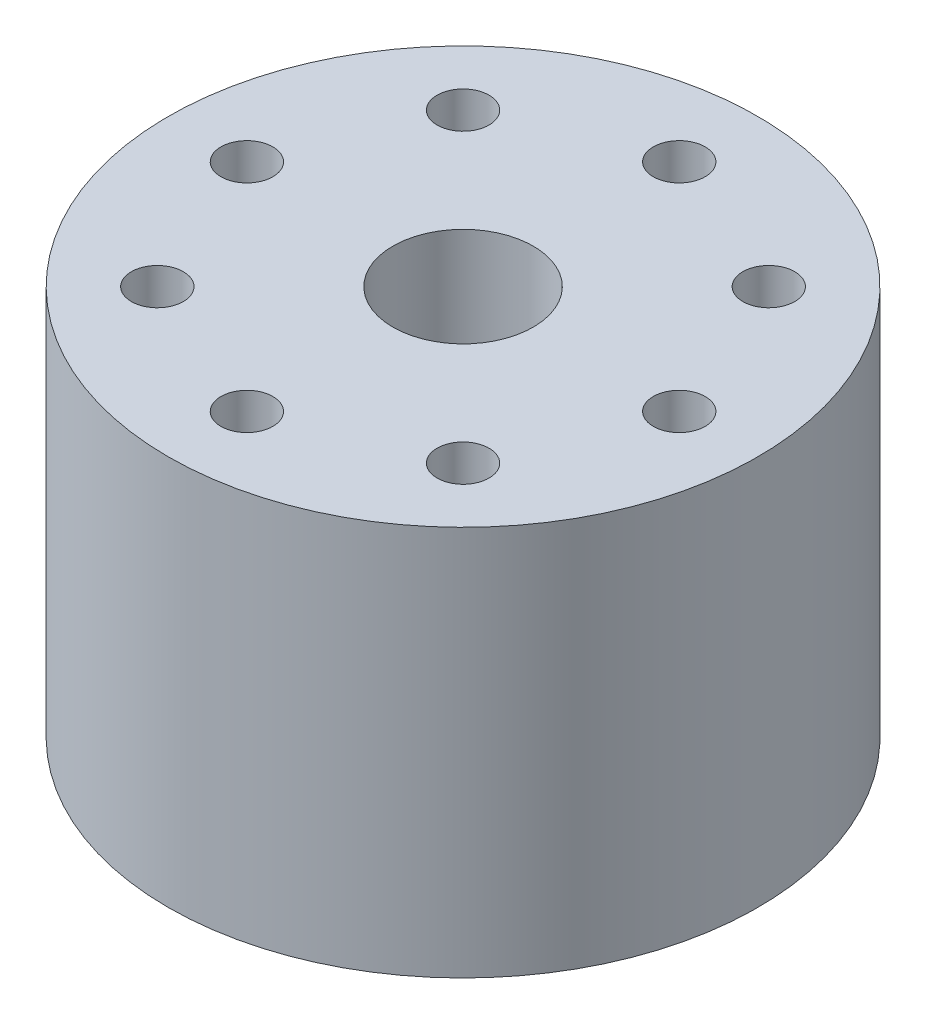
ISO-10303-21;
HEADER;
FILE_DESCRIPTION(('STEP AP214'),'2;1');
FILE_NAME('part.step','',(''),(''),'','','');
FILE_SCHEMA(('AUTOMOTIVE_DESIGN { 1 0 10303 214 1 1 1 1 }'));
ENDSEC;
DATA;
#1=APPLICATION_CONTEXT('core data for automotive mechanical design processes');
#2=APPLICATION_PROTOCOL_DEFINITION('international standard','automotive_design',2000,#1);
#3=PRODUCT_CONTEXT('',#1,'mechanical');
#4=PRODUCT('Part','Part','',(#3));
#5=PRODUCT_RELATED_PRODUCT_CATEGORY('part','',(#4));
#6=PRODUCT_DEFINITION_FORMATION('','',#4);
#7=PRODUCT_DEFINITION_CONTEXT('part definition',#1,'design');
#8=PRODUCT_DEFINITION('design','',#6,#7);
#9=PRODUCT_DEFINITION_SHAPE('','',#8);
#10=(LENGTH_UNIT() NAMED_UNIT(*) SI_UNIT(.MILLI.,.METRE.));
#11=(NAMED_UNIT(*) PLANE_ANGLE_UNIT() SI_UNIT($,.RADIAN.));
#12=(NAMED_UNIT(*) SI_UNIT($,.STERADIAN.) SOLID_ANGLE_UNIT());
#13=UNCERTAINTY_MEASURE_WITH_UNIT(LENGTH_MEASURE(1.E-05),#10,'distance_accuracy_value','');
#14=(GEOMETRIC_REPRESENTATION_CONTEXT(3) GLOBAL_UNCERTAINTY_ASSIGNED_CONTEXT((#13)) GLOBAL_UNIT_ASSIGNED_CONTEXT((#10,
#11,#12)) REPRESENTATION_CONTEXT('',''));
#15=CARTESIAN_POINT('',(0.,0.,0.));
#16=DIRECTION('',(0.,0.,1.));
#17=DIRECTION('',(1.,0.,0.));
#18=AXIS2_PLACEMENT_3D('',#15,#16,#17);
#19=CARTESIAN_POINT('',(0.,49.65,0.));
#20=DIRECTION('',(0.,-1.,0.));
#21=DIRECTION('',(0.,0.,-1.));
#22=AXIS2_PLACEMENT_3D('',#19,#20,#21);
#23=CYLINDRICAL_SURFACE('',#22,37.5);
#24=CARTESIAN_POINT('',(0.,49.65,0.));
#25=DIRECTION('',(0.,1.,0.));
#26=DIRECTION('',(0.,0.,1.));
#27=AXIS2_PLACEMENT_3D('',#24,#25,#26);
#28=CIRCLE('',#27,37.5);
#29=CARTESIAN_POINT('',(0.,49.65,37.5));
#30=VERTEX_POINT('',#29);
#31=EDGE_CURVE('E54',#30,#30,#28,.T.);
#32=ORIENTED_EDGE('',*,*,#31,.F.);
#33=EDGE_LOOP('',(#32));
#34=FACE_BOUND('',#33,.T.);
#35=CARTESIAN_POINT('',(0.,0.,0.));
#36=DIRECTION('',(0.,1.,0.));
#37=DIRECTION('',(0.,0.,1.));
#38=AXIS2_PLACEMENT_3D('',#35,#36,#37);
#39=CIRCLE('',#38,37.5);
#40=CARTESIAN_POINT('',(0.,0.,37.5));
#41=VERTEX_POINT('',#40);
#42=EDGE_CURVE('E58',#41,#41,#39,.T.);
#43=ORIENTED_EDGE('',*,*,#42,.T.);
#44=EDGE_LOOP('',(#43));
#45=FACE_BOUND('',#44,.T.);
#46=ADVANCED_FACE('F43',(#34,#45),#23,.T.);
#47=CARTESIAN_POINT('',(0.,49.65,0.));
#48=DIRECTION('',(0.,1.,0.));
#49=DIRECTION('',(0.,0.,1.));
#50=AXIS2_PLACEMENT_3D('',#47,#48,#49);
#51=PLANE('',#50);
#52=CARTESIAN_POINT('',(0.,49.65,27.5));
#53=DIRECTION('',(0.,1.,0.));
#54=DIRECTION('',(0.,0.,1.));
#55=AXIS2_PLACEMENT_3D('',#52,#53,#54);
#56=CIRCLE('',#55,3.3);
#57=CARTESIAN_POINT('',(0.,49.65,30.8));
#58=VERTEX_POINT('',#57);
#59=EDGE_CURVE('E276',#58,#58,#56,.T.);
#60=ORIENTED_EDGE('',*,*,#59,.F.);
#61=EDGE_LOOP('',(#60));
#62=FACE_BOUND('',#61,.T.);
#63=CARTESIAN_POINT('',(-19.4454364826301,49.65,19.44543648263));
#64=DIRECTION('',(0.,1.,0.));
#65=DIRECTION('',(0.,0.,1.));
#66=AXIS2_PLACEMENT_3D('',#63,#64,#65);
#67=CIRCLE('',#66,3.3);
#68=CARTESIAN_POINT('',(-19.4454364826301,49.65,22.74543648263));
#69=VERTEX_POINT('',#68);
#70=EDGE_CURVE('E281',#69,#69,#67,.T.);
#71=ORIENTED_EDGE('',*,*,#70,.F.);
#72=EDGE_LOOP('',(#71));
#73=FACE_BOUND('',#72,.T.);
#74=CARTESIAN_POINT('',(-27.5,49.65,0.));
#75=DIRECTION('',(0.,1.,0.));
#76=DIRECTION('',(0.,0.,1.));
#77=AXIS2_PLACEMENT_3D('',#74,#75,#76);
#78=CIRCLE('',#77,3.3);
#79=CARTESIAN_POINT('',(-27.5,49.65,3.2999999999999));
#80=VERTEX_POINT('',#79);
#81=EDGE_CURVE('E292',#80,#80,#78,.T.);
#82=ORIENTED_EDGE('',*,*,#81,.F.);
#83=EDGE_LOOP('',(#82));
#84=FACE_BOUND('',#83,.T.);
#85=CARTESIAN_POINT('',(-19.44543648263,49.65,-19.4454364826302));
#86=DIRECTION('',(0.,1.,0.));
#87=DIRECTION('',(0.,0.,1.));
#88=AXIS2_PLACEMENT_3D('',#85,#86,#87);
#89=CIRCLE('',#88,3.3);
#90=CARTESIAN_POINT('',(-19.44543648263,49.65,-16.1454364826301));
#91=VERTEX_POINT('',#90);
#92=EDGE_CURVE('E298',#91,#91,#89,.T.);
#93=ORIENTED_EDGE('',*,*,#92,.F.);
#94=EDGE_LOOP('',(#93));
#95=FACE_BOUND('',#94,.T.);
#96=CARTESIAN_POINT('',(1.92031473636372E-13,49.65,-27.5));
#97=DIRECTION('',(0.,1.,0.));
#98=DIRECTION('',(0.,0.,1.));
#99=AXIS2_PLACEMENT_3D('',#96,#97,#98);
#100=CIRCLE('',#99,3.3);
#101=CARTESIAN_POINT('',(1.92031473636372E-13,49.65,-24.2));
#102=VERTEX_POINT('',#101);
#103=EDGE_CURVE('E304',#102,#102,#100,.T.);
#104=ORIENTED_EDGE('',*,*,#103,.F.);
#105=EDGE_LOOP('',(#104));
#106=FACE_BOUND('',#105,.T.);
#107=CARTESIAN_POINT('',(19.4454364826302,49.65,-19.4454364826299));
#108=DIRECTION('',(0.,1.,0.));
#109=DIRECTION('',(0.,0.,1.));
#110=AXIS2_PLACEMENT_3D('',#107,#108,#109);
#111=CIRCLE('',#110,3.3);
#112=CARTESIAN_POINT('',(19.4454364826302,49.65,-16.1454364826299));
#113=VERTEX_POINT('',#112);
#114=EDGE_CURVE('E329',#113,#113,#111,.T.);
#115=ORIENTED_EDGE('',*,*,#114,.F.);
#116=EDGE_LOOP('',(#115));
#117=FACE_BOUND('',#116,.T.);
#118=CARTESIAN_POINT('',(27.5,49.65,2.88047210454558E-13));
#119=DIRECTION('',(0.,1.,0.));
#120=DIRECTION('',(0.,0.,1.));
#121=AXIS2_PLACEMENT_3D('',#118,#119,#120);
#122=CIRCLE('',#121,3.3);
#123=CARTESIAN_POINT('',(27.5,49.65,3.30000000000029));
#124=VERTEX_POINT('',#123);
#125=EDGE_CURVE('E336',#124,#124,#122,.T.);
#126=ORIENTED_EDGE('',*,*,#125,.F.);
#127=EDGE_LOOP('',(#126));
#128=FACE_BOUND('',#127,.T.);
#129=CARTESIAN_POINT('',(19.4454364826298,49.65,19.4454364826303));
#130=DIRECTION('',(0.,1.,0.));
#131=DIRECTION('',(0.,0.,1.));
#132=AXIS2_PLACEMENT_3D('',#129,#130,#131);
#133=CIRCLE('',#132,3.3);
#134=CARTESIAN_POINT('',(19.4454364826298,49.65,22.7454364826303));
#135=VERTEX_POINT('',#134);
#136=EDGE_CURVE('E277',#135,#135,#133,.T.);
#137=ORIENTED_EDGE('',*,*,#136,.F.);
#138=EDGE_LOOP('',(#137));
#139=FACE_BOUND('',#138,.T.);
#140=CARTESIAN_POINT('',(0.,49.65,0.));
#141=DIRECTION('',(0.,1.,0.));
#142=DIRECTION('',(0.,0.,1.));
#143=AXIS2_PLACEMENT_3D('',#140,#141,#142);
#144=CIRCLE('',#143,8.93);
#145=CARTESIAN_POINT('',(0.,49.65,8.93));
#146=VERTEX_POINT('',#145);
#147=EDGE_CURVE('E62',#146,#146,#144,.T.);
#148=ORIENTED_EDGE('',*,*,#147,.F.);
#149=EDGE_LOOP('',(#148));
#150=FACE_BOUND('',#149,.T.);
#151=ORIENTED_EDGE('',*,*,#31,.T.);
#152=EDGE_LOOP('',(#151));
#153=FACE_BOUND('',#152,.T.);
#154=ADVANCED_FACE('F108',(#62,#73,#84,#95,#106,#117,#128,#139,#150,#153),#51,.T.);
#155=CARTESIAN_POINT('',(0.,0.,0.));
#156=DIRECTION('',(0.,1.,0.));
#157=DIRECTION('',(0.,0.,1.));
#158=AXIS2_PLACEMENT_3D('',#155,#156,#157);
#159=PLANE('',#158);
#160=CARTESIAN_POINT('',(0.,0.,27.5));
#161=DIRECTION('',(0.,1.,0.));
#162=DIRECTION('',(0.,0.,1.));
#163=AXIS2_PLACEMENT_3D('',#160,#161,#162);
#164=CIRCLE('',#163,3.3);
#165=CARTESIAN_POINT('',(0.,0.,30.8));
#166=VERTEX_POINT('',#165);
#167=EDGE_CURVE('E273',#166,#166,#164,.T.);
#168=ORIENTED_EDGE('',*,*,#167,.T.);
#169=EDGE_LOOP('',(#168));
#170=FACE_BOUND('',#169,.T.);
#171=CARTESIAN_POINT('',(-19.4454364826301,0.,19.44543648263));
#172=DIRECTION('',(0.,1.,0.));
#173=DIRECTION('',(0.,0.,1.));
#174=AXIS2_PLACEMENT_3D('',#171,#172,#173);
#175=CIRCLE('',#174,3.3);
#176=CARTESIAN_POINT('',(-19.4454364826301,0.,22.74543648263));
#177=VERTEX_POINT('',#176);
#178=EDGE_CURVE('E289',#177,#177,#175,.T.);
#179=ORIENTED_EDGE('',*,*,#178,.T.);
#180=EDGE_LOOP('',(#179));
#181=FACE_BOUND('',#180,.T.);
#182=CARTESIAN_POINT('',(-27.5,0.,0.));
#183=DIRECTION('',(0.,1.,0.));
#184=DIRECTION('',(0.,0.,1.));
#185=AXIS2_PLACEMENT_3D('',#182,#183,#184);
#186=CIRCLE('',#185,3.3);
#187=CARTESIAN_POINT('',(-27.5,0.,3.2999999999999));
#188=VERTEX_POINT('',#187);
#189=EDGE_CURVE('E295',#188,#188,#186,.T.);
#190=ORIENTED_EDGE('',*,*,#189,.T.);
#191=EDGE_LOOP('',(#190));
#192=FACE_BOUND('',#191,.T.);
#193=CARTESIAN_POINT('',(-19.44543648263,0.,-19.4454364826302));
#194=DIRECTION('',(0.,1.,0.));
#195=DIRECTION('',(0.,0.,1.));
#196=AXIS2_PLACEMENT_3D('',#193,#194,#195);
#197=CIRCLE('',#196,3.3);
#198=CARTESIAN_POINT('',(-19.44543648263,0.,-16.1454364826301));
#199=VERTEX_POINT('',#198);
#200=EDGE_CURVE('E301',#199,#199,#197,.T.);
#201=ORIENTED_EDGE('',*,*,#200,.T.);
#202=EDGE_LOOP('',(#201));
#203=FACE_BOUND('',#202,.T.);
#204=CARTESIAN_POINT('',(1.92031473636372E-13,0.,-27.5));
#205=DIRECTION('',(0.,1.,0.));
#206=DIRECTION('',(0.,0.,1.));
#207=AXIS2_PLACEMENT_3D('',#204,#205,#206);
#208=CIRCLE('',#207,3.3);
#209=CARTESIAN_POINT('',(1.92031473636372E-13,0.,-24.2));
#210=VERTEX_POINT('',#209);
#211=EDGE_CURVE('E324',#210,#210,#208,.T.);
#212=ORIENTED_EDGE('',*,*,#211,.T.);
#213=EDGE_LOOP('',(#212));
#214=FACE_BOUND('',#213,.T.);
#215=CARTESIAN_POINT('',(19.4454364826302,0.,-19.4454364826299));
#216=DIRECTION('',(0.,1.,0.));
#217=DIRECTION('',(0.,0.,1.));
#218=AXIS2_PLACEMENT_3D('',#215,#216,#217);
#219=CIRCLE('',#218,3.3);
#220=CARTESIAN_POINT('',(19.4454364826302,0.,-16.1454364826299));
#221=VERTEX_POINT('',#220);
#222=EDGE_CURVE('E334',#221,#221,#219,.T.);
#223=ORIENTED_EDGE('',*,*,#222,.T.);
#224=EDGE_LOOP('',(#223));
#225=FACE_BOUND('',#224,.T.);
#226=CARTESIAN_POINT('',(27.5,0.,2.88047210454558E-13));
#227=DIRECTION('',(0.,1.,0.));
#228=DIRECTION('',(0.,0.,1.));
#229=AXIS2_PLACEMENT_3D('',#226,#227,#228);
#230=CIRCLE('',#229,3.3);
#231=CARTESIAN_POINT('',(27.5,0.,3.30000000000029));
#232=VERTEX_POINT('',#231);
#233=EDGE_CURVE('E284',#232,#232,#230,.T.);
#234=ORIENTED_EDGE('',*,*,#233,.T.);
#235=EDGE_LOOP('',(#234));
#236=FACE_BOUND('',#235,.T.);
#237=CARTESIAN_POINT('',(19.4454364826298,0.,19.4454364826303));
#238=DIRECTION('',(0.,1.,0.));
#239=DIRECTION('',(0.,0.,1.));
#240=AXIS2_PLACEMENT_3D('',#237,#238,#239);
#241=CIRCLE('',#240,3.3);
#242=CARTESIAN_POINT('',(19.4454364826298,0.,22.7454364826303));
#243=VERTEX_POINT('',#242);
#244=EDGE_CURVE('E280',#243,#243,#241,.T.);
#245=ORIENTED_EDGE('',*,*,#244,.T.);
#246=EDGE_LOOP('',(#245));
#247=FACE_BOUND('',#246,.T.);
#248=CARTESIAN_POINT('',(0.,0.,0.));
#249=DIRECTION('',(0.,-1.,0.));
#250=DIRECTION('',(0.,0.,-1.));
#251=AXIS2_PLACEMENT_3D('',#248,#249,#250);
#252=CIRCLE('',#251,14.);
#253=CARTESIAN_POINT('',(0.,0.,-14.));
#254=VERTEX_POINT('',#253);
#255=EDGE_CURVE('E72',#254,#254,#252,.T.);
#256=ORIENTED_EDGE('',*,*,#255,.F.);
#257=EDGE_LOOP('',(#256));
#258=FACE_BOUND('',#257,.T.);
#259=ORIENTED_EDGE('',*,*,#42,.F.);
#260=EDGE_LOOP('',(#259));
#261=FACE_BOUND('',#260,.T.);
#262=ADVANCED_FACE('F106',(#170,#181,#192,#203,#214,#225,#236,#247,#258,#261),#159,.F.);
#263=CARTESIAN_POINT('',(0.,26.65,0.));
#264=DIRECTION('',(0.,1.,0.));
#265=DIRECTION('',(0.,0.,1.));
#266=AXIS2_PLACEMENT_3D('',#263,#264,#265);
#267=CYLINDRICAL_SURFACE('',#266,8.93);
#268=CARTESIAN_POINT('',(0.,26.65,0.));
#269=DIRECTION('',(0.,1.,0.));
#270=DIRECTION('',(0.,0.,1.));
#271=AXIS2_PLACEMENT_3D('',#268,#269,#270);
#272=CIRCLE('',#271,8.93);
#273=CARTESIAN_POINT('',(0.,26.65,8.93));
#274=VERTEX_POINT('',#273);
#275=EDGE_CURVE('E67',#274,#274,#272,.T.);
#276=ORIENTED_EDGE('',*,*,#275,.F.);
#277=EDGE_LOOP('',(#276));
#278=FACE_BOUND('',#277,.T.);
#279=ORIENTED_EDGE('',*,*,#147,.T.);
#280=EDGE_LOOP('',(#279));
#281=FACE_BOUND('',#280,.T.);
#282=ADVANCED_FACE('F99',(#278,#281),#267,.F.);
#283=CARTESIAN_POINT('',(0.,3.15,0.));
#284=DIRECTION('',(0.,-1.,0.));
#285=DIRECTION('',(0.,0.,-1.));
#286=AXIS2_PLACEMENT_3D('',#283,#284,#285);
#287=PLANE('',#286);
#288=CARTESIAN_POINT('',(0.,3.15,0.));
#289=DIRECTION('',(0.,-1.,0.));
#290=DIRECTION('',(0.,0.,-1.));
#291=AXIS2_PLACEMENT_3D('',#288,#289,#290);
#292=CIRCLE('',#291,14.);
#293=CARTESIAN_POINT('',(0.,3.15,-14.));
#294=VERTEX_POINT('',#293);
#295=EDGE_CURVE('E66',#294,#294,#292,.T.);
#296=ORIENTED_EDGE('',*,*,#295,.T.);
#297=EDGE_LOOP('',(#296));
#298=FACE_BOUND('',#297,.T.);
#299=CARTESIAN_POINT('',(0.,3.15,0.));
#300=DIRECTION('',(0.,-1.,0.));
#301=DIRECTION('',(0.,0.,-1.));
#302=AXIS2_PLACEMENT_3D('',#299,#300,#301);
#303=CIRCLE('',#302,10.);
#304=CARTESIAN_POINT('',(0.,3.15,-10.));
#305=VERTEX_POINT('',#304);
#306=EDGE_CURVE('E70',#305,#305,#303,.T.);
#307=ORIENTED_EDGE('',*,*,#306,.F.);
#308=EDGE_LOOP('',(#307));
#309=FACE_BOUND('',#308,.T.);
#310=ADVANCED_FACE('F96',(#298,#309),#287,.T.);
#311=CARTESIAN_POINT('',(0.,3.15,0.));
#312=DIRECTION('',(0.,-1.,0.));
#313=DIRECTION('',(0.,0.,-1.));
#314=AXIS2_PLACEMENT_3D('',#311,#312,#313);
#315=CYLINDRICAL_SURFACE('',#314,14.);
#316=ORIENTED_EDGE('',*,*,#295,.F.);
#317=EDGE_LOOP('',(#316));
#318=FACE_BOUND('',#317,.T.);
#319=ORIENTED_EDGE('',*,*,#255,.T.);
#320=EDGE_LOOP('',(#319));
#321=FACE_BOUND('',#320,.T.);
#322=ADVANCED_FACE('F93',(#318,#321),#315,.F.);
#323=CARTESIAN_POINT('',(-10.,17.35,0.));
#324=CARTESIAN_POINT('',(-16.,10.25,0.));
#325=CARTESIAN_POINT('',(-10.,3.15,0.));
#326=B_SPLINE_CURVE_WITH_KNOTS('',2,(#323,#324,#325),.UNSPECIFIED.,.F.,.F.,(3,3),(0.,1.),.UNSPECIFIED.);
#327=CARTESIAN_POINT('',(0.,3.15,0.));
#328=DIRECTION('',(0.,-1.,0.));
#329=AXIS1_PLACEMENT('',#327,#328);
#330=SURFACE_OF_REVOLUTION('',#326,#329);
#331=ORIENTED_EDGE('',*,*,#306,.T.);
#332=EDGE_LOOP('',(#331));
#333=FACE_BOUND('',#332,.T.);
#334=CARTESIAN_POINT('',(0.,17.35,0.));
#335=DIRECTION('',(0.,1.,0.));
#336=DIRECTION('',(-1.,0.,0.));
#337=AXIS2_PLACEMENT_3D('',#334,#335,#336);
#338=CIRCLE('',#337,10.);
#339=CARTESIAN_POINT('',(-10.,17.35,0.));
#340=VERTEX_POINT('',#339);
#341=EDGE_CURVE('E71',#340,#340,#338,.T.);
#342=ORIENTED_EDGE('',*,*,#341,.T.);
#343=EDGE_LOOP('',(#342));
#344=FACE_BOUND('',#343,.T.);
#345=ADVANCED_FACE('F88',(#333,#344),#330,.F.);
#346=CARTESIAN_POINT('',(-10.,26.65,0.));
#347=DIRECTION('',(0.,1.,0.));
#348=DIRECTION('',(-1.,0.,0.));
#349=AXIS2_PLACEMENT_3D('',#346,#347,#348);
#350=PLANE('',#349);
#351=CARTESIAN_POINT('',(0.,26.65,0.));
#352=DIRECTION('',(0.,1.,0.));
#353=DIRECTION('',(-1.,0.,0.));
#354=AXIS2_PLACEMENT_3D('',#351,#352,#353);
#355=CIRCLE('',#354,8.99999999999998);
#356=CARTESIAN_POINT('',(-8.99999999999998,26.65,0.));
#357=VERTEX_POINT('',#356);
#358=EDGE_CURVE('E11',#357,#357,#355,.F.);
#359=ORIENTED_EDGE('',*,*,#358,.T.);
#360=EDGE_LOOP('',(#359));
#361=FACE_BOUND('',#360,.T.);
#362=ORIENTED_EDGE('',*,*,#275,.T.);
#363=EDGE_LOOP('',(#362));
#364=FACE_BOUND('',#363,.T.);
#365=ADVANCED_FACE('F92',(#361,#364),#350,.F.);
#366=CARTESIAN_POINT('',(0.,26.65,0.));
#367=DIRECTION('',(0.,1.,0.));
#368=DIRECTION('',(-1.,0.,0.));
#369=AXIS2_PLACEMENT_3D('',#366,#367,#368);
#370=CYLINDRICAL_SURFACE('',#369,10.);
#371=CARTESIAN_POINT('',(0.,22.917949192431,0.));
#372=DIRECTION('',(0.,1.,0.));
#373=DIRECTION('',(-1.,0.,0.));
#374=AXIS2_PLACEMENT_3D('',#371,#372,#373);
#375=CIRCLE('',#374,10.);
#376=CARTESIAN_POINT('',(-10.,22.9179491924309,0.));
#377=VERTEX_POINT('',#376);
#378=EDGE_CURVE('E50',#377,#377,#375,.T.);
#379=ORIENTED_EDGE('',*,*,#378,.T.);
#380=EDGE_LOOP('',(#379));
#381=FACE_BOUND('',#380,.T.);
#382=ORIENTED_EDGE('',*,*,#341,.F.);
#383=EDGE_LOOP('',(#382));
#384=FACE_BOUND('',#383,.T.);
#385=ADVANCED_FACE('F154',(#381,#384),#370,.F.);
#386=CARTESIAN_POINT('',(19.4454364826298,0.,19.4454364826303));
#387=DIRECTION('',(0.,1.,0.));
#388=DIRECTION('',(0.,0.,1.));
#389=AXIS2_PLACEMENT_3D('',#386,#387,#388);
#390=CYLINDRICAL_SURFACE('',#389,3.3);
#391=ORIENTED_EDGE('',*,*,#244,.F.);
#392=EDGE_LOOP('',(#391));
#393=FACE_BOUND('',#392,.T.);
#394=ORIENTED_EDGE('',*,*,#136,.T.);
#395=EDGE_LOOP('',(#394));
#396=FACE_BOUND('',#395,.T.);
#397=ADVANCED_FACE('F161',(#393,#396),#390,.F.);
#398=CARTESIAN_POINT('',(27.5,0.,2.88047210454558E-13));
#399=DIRECTION('',(0.,1.,0.));
#400=DIRECTION('',(0.,0.,1.));
#401=AXIS2_PLACEMENT_3D('',#398,#399,#400);
#402=CYLINDRICAL_SURFACE('',#401,3.3);
#403=ORIENTED_EDGE('',*,*,#125,.T.);
#404=EDGE_LOOP('',(#403));
#405=FACE_BOUND('',#404,.T.);
#406=ORIENTED_EDGE('',*,*,#233,.F.);
#407=EDGE_LOOP('',(#406));
#408=FACE_BOUND('',#407,.T.);
#409=ADVANCED_FACE('F167',(#405,#408),#402,.F.);
#410=CARTESIAN_POINT('',(19.4454364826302,0.,-19.4454364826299));
#411=DIRECTION('',(0.,1.,0.));
#412=DIRECTION('',(0.,0.,1.));
#413=AXIS2_PLACEMENT_3D('',#410,#411,#412);
#414=CYLINDRICAL_SURFACE('',#413,3.3);
#415=ORIENTED_EDGE('',*,*,#222,.F.);
#416=EDGE_LOOP('',(#415));
#417=FACE_BOUND('',#416,.T.);
#418=ORIENTED_EDGE('',*,*,#114,.T.);
#419=EDGE_LOOP('',(#418));
#420=FACE_BOUND('',#419,.T.);
#421=ADVANCED_FACE('F175',(#417,#420),#414,.F.);
#422=CARTESIAN_POINT('',(1.92031473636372E-13,0.,-27.5));
#423=DIRECTION('',(0.,1.,0.));
#424=DIRECTION('',(0.,0.,1.));
#425=AXIS2_PLACEMENT_3D('',#422,#423,#424);
#426=CYLINDRICAL_SURFACE('',#425,3.3);
#427=ORIENTED_EDGE('',*,*,#211,.F.);
#428=EDGE_LOOP('',(#427));
#429=FACE_BOUND('',#428,.T.);
#430=ORIENTED_EDGE('',*,*,#103,.T.);
#431=EDGE_LOOP('',(#430));
#432=FACE_BOUND('',#431,.T.);
#433=ADVANCED_FACE('F183',(#429,#432),#426,.F.);
#434=CARTESIAN_POINT('',(-19.44543648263,0.,-19.4454364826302));
#435=DIRECTION('',(0.,1.,0.));
#436=DIRECTION('',(0.,0.,1.));
#437=AXIS2_PLACEMENT_3D('',#434,#435,#436);
#438=CYLINDRICAL_SURFACE('',#437,3.3);
#439=ORIENTED_EDGE('',*,*,#200,.F.);
#440=EDGE_LOOP('',(#439));
#441=FACE_BOUND('',#440,.T.);
#442=ORIENTED_EDGE('',*,*,#92,.T.);
#443=EDGE_LOOP('',(#442));
#444=FACE_BOUND('',#443,.T.);
#445=ADVANCED_FACE('F191',(#441,#444),#438,.F.);
#446=CARTESIAN_POINT('',(-27.5,0.,0.));
#447=DIRECTION('',(0.,1.,0.));
#448=DIRECTION('',(0.,0.,1.));
#449=AXIS2_PLACEMENT_3D('',#446,#447,#448);
#450=CYLINDRICAL_SURFACE('',#449,3.3);
#451=ORIENTED_EDGE('',*,*,#189,.F.);
#452=EDGE_LOOP('',(#451));
#453=FACE_BOUND('',#452,.T.);
#454=ORIENTED_EDGE('',*,*,#81,.T.);
#455=EDGE_LOOP('',(#454));
#456=FACE_BOUND('',#455,.T.);
#457=ADVANCED_FACE('F199',(#453,#456),#450,.F.);
#458=CARTESIAN_POINT('',(-19.4454364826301,0.,19.44543648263));
#459=DIRECTION('',(0.,1.,0.));
#460=DIRECTION('',(0.,0.,1.));
#461=AXIS2_PLACEMENT_3D('',#458,#459,#460);
#462=CYLINDRICAL_SURFACE('',#461,3.3);
#463=ORIENTED_EDGE('',*,*,#178,.F.);
#464=EDGE_LOOP('',(#463));
#465=FACE_BOUND('',#464,.T.);
#466=ORIENTED_EDGE('',*,*,#70,.T.);
#467=EDGE_LOOP('',(#466));
#468=FACE_BOUND('',#467,.T.);
#469=ADVANCED_FACE('F207',(#465,#468),#462,.F.);
#470=CARTESIAN_POINT('',(0.,0.,27.5));
#471=DIRECTION('',(0.,1.,0.));
#472=DIRECTION('',(0.,0.,1.));
#473=AXIS2_PLACEMENT_3D('',#470,#471,#472);
#474=CYLINDRICAL_SURFACE('',#473,3.3);
#475=ORIENTED_EDGE('',*,*,#167,.F.);
#476=EDGE_LOOP('',(#475));
#477=FACE_BOUND('',#476,.T.);
#478=ORIENTED_EDGE('',*,*,#59,.T.);
#479=EDGE_LOOP('',(#478));
#480=FACE_BOUND('',#479,.T.);
#481=ADVANCED_FACE('F215',(#477,#480),#474,.F.);
#482=CARTESIAN_POINT('',(0.,22.917949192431,0.));
#483=DIRECTION('',(0.,-1.,0.));
#484=DIRECTION('',(1.,0.,0.));
#485=AXIS2_PLACEMENT_3D('',#482,#483,#484);
#486=CONICAL_SURFACE('',#485,10.,0.261799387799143);
#487=ORIENTED_EDGE('',*,*,#358,.F.);
#488=EDGE_LOOP('',(#487));
#489=FACE_BOUND('',#488,.T.);
#490=ORIENTED_EDGE('',*,*,#378,.F.);
#491=EDGE_LOOP('',(#490));
#492=FACE_BOUND('',#491,.T.);
#493=ADVANCED_FACE('F45',(#489,#492),#486,.F.);
#494=CLOSED_SHELL('',(#46,#154,#262,#282,#310,#322,#345,#365,#385,#397,#409,#421,#433,#445,#457,
#469,#481,#493));
#495=MANIFOLD_SOLID_BREP('B2',#494);
#496=ADVANCED_BREP_SHAPE_REPRESENTATION('',(#18,#495),#14);
#497=SHAPE_DEFINITION_REPRESENTATION(#9,#496);
ENDSEC;
END-ISO-10303-21;
